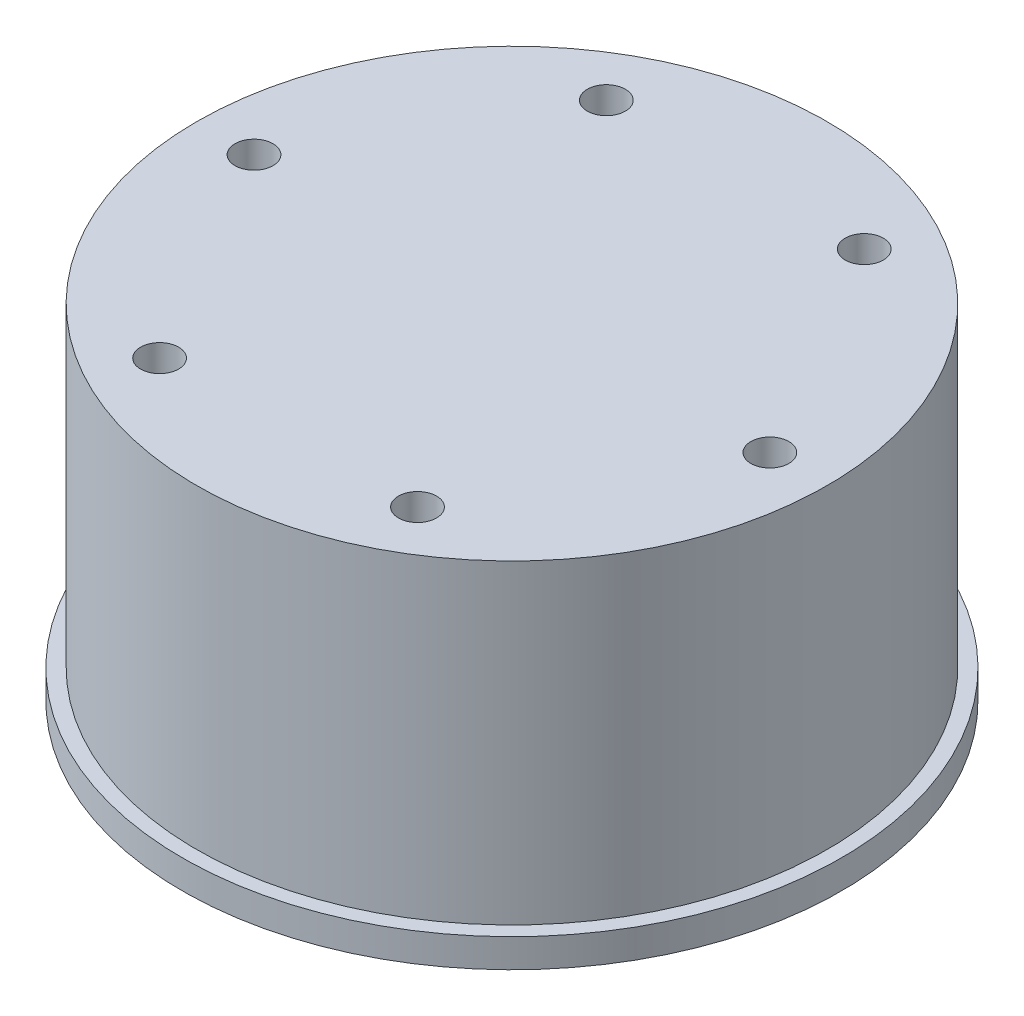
from build123d import *

# Parameters (mm, degrees)
CIRPATTERN1_COUNT = 6


with BuildPart() as part:
    # Sketch1 → Revolve1 (revolve)
    with BuildSketch(Plane.XY, mode=Mode.PRIVATE) as revolve1_sk:
        Polygon((0, 76.2), (69.85, 76.2), (69.85, 6.35), (73.025, 6.35), (73.025, 0), (0, 0), align=None)
    revolve(revolve1_sk.sketch.rotate(Axis((0, 76.2, 0), (0, -1, 0)), 180), axis=Axis((0, 76.2, 0), (0, -1, 0)))

    # Sketch5 → 3_8-24 Tapped Hole2 (revolve, cut)
    with BuildSketch(Plane(origin=(-57.15, 76.2, 0), x_dir=(0, 0, 1), z_dir=(1, 0, 0))):
        Polygon((0, 0), (0, 26.879368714), (4.2164, 24.3459), (4.2164, 0), align=None)
    f_3_8_24_tapped_hole2 = revolve(axis=Axis((-57.15, 82.55, 0), (0, -1, 0)), mode=Mode.SUBTRACT)

    # CirPattern1: 3_8-24 Tapped Hole2 ×6 about axis
    cirpattern1_axis = Axis((0, 0, 0), (0, 1, 0))
    for i in range(1, CIRPATTERN1_COUNT):
        add(f_3_8_24_tapped_hole2.rotate(cirpattern1_axis, i * 360 / CIRPATTERN1_COUNT), mode=Mode.SUBTRACT)


solid = part.part
